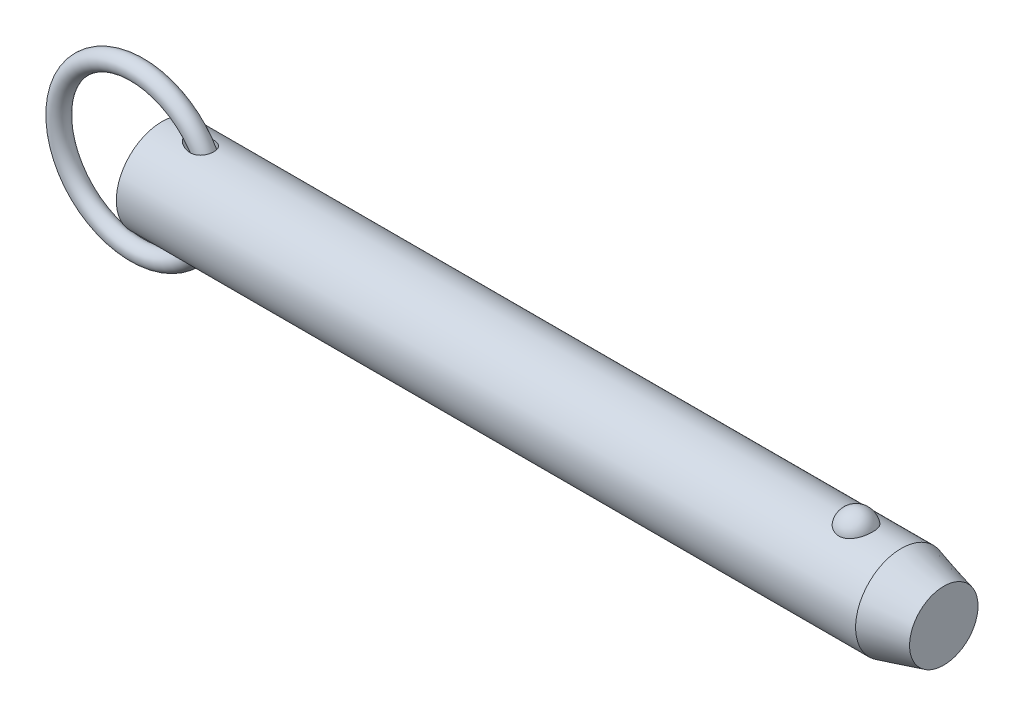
ISO-10303-21;
HEADER;
FILE_DESCRIPTION(('STEP AP214'),'2;1');
FILE_NAME('part.step','',(''),(''),'','','');
FILE_SCHEMA(('AUTOMOTIVE_DESIGN { 1 0 10303 214 1 1 1 1 }'));
ENDSEC;
DATA;
#1=APPLICATION_CONTEXT('core data for automotive mechanical design processes');
#2=APPLICATION_PROTOCOL_DEFINITION('international standard','automotive_design',2000,#1);
#3=PRODUCT_CONTEXT('',#1,'mechanical');
#4=PRODUCT('Part','Part','',(#3));
#5=PRODUCT_RELATED_PRODUCT_CATEGORY('part','',(#4));
#6=PRODUCT_DEFINITION_FORMATION('','',#4);
#7=PRODUCT_DEFINITION_CONTEXT('part definition',#1,'design');
#8=PRODUCT_DEFINITION('design','',#6,#7);
#9=PRODUCT_DEFINITION_SHAPE('','',#8);
#10=(LENGTH_UNIT() NAMED_UNIT(*) SI_UNIT(.MILLI.,.METRE.));
#11=(NAMED_UNIT(*) PLANE_ANGLE_UNIT() SI_UNIT($,.RADIAN.));
#12=(NAMED_UNIT(*) SI_UNIT($,.STERADIAN.) SOLID_ANGLE_UNIT());
#13=UNCERTAINTY_MEASURE_WITH_UNIT(LENGTH_MEASURE(1.E-05),#10,'distance_accuracy_value','');
#14=(GEOMETRIC_REPRESENTATION_CONTEXT(3) GLOBAL_UNCERTAINTY_ASSIGNED_CONTEXT((#13)) GLOBAL_UNIT_ASSIGNED_CONTEXT((#10,
#11,#12)) REPRESENTATION_CONTEXT('',''));
#15=CARTESIAN_POINT('',(0.,0.,0.));
#16=DIRECTION('',(0.,0.,1.));
#17=DIRECTION('',(1.,0.,0.));
#18=AXIS2_PLACEMENT_3D('',#15,#16,#17);
#19=CARTESIAN_POINT('',(-6.08699288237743,0.,0.));
#20=DIRECTION('',(0.,0.,1.));
#21=DIRECTION('',(1.,0.,0.));
#22=AXIS2_PLACEMENT_3D('',#19,#20,#21);
#23=TOROIDAL_SURFACE('',#22,19.05,2.223);
#24=CARTESIAN_POINT('',(15.1860071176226,0.,0.));
#25=VERTEX_POINT('',#24);
#26=VERTEX_LOOP('',#25);
#27=FACE_BOUND('',#26,.T.);
#28=ADVANCED_FACE('P0_F12',(#27),#23,.T.);
#29=CLOSED_SHELL('',(#28));
#30=MANIFOLD_SOLID_BREP('P0_B1',#29);
#31=CARTESIAN_POINT('',(0.,0.,0.));
#32=DIRECTION('',(1.,0.,0.));
#33=DIRECTION('',(0.,0.,-1.));
#34=AXIS2_PLACEMENT_3D('',#31,#32,#33);
#35=CYLINDRICAL_SURFACE('',#34,11.115);
#36=CARTESIAN_POINT('',(6.41405181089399,11.0227946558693,-1.4287136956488));
#37=CARTESIAN_POINT('',(6.49338916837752,11.0115377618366,-1.51556642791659));
#38=CARTESIAN_POINT('',(6.5776546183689,10.9998263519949,-1.59789397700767));
#39=CARTESIAN_POINT('',(6.75386647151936,10.9760304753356,-1.75391400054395));
#40=CARTESIAN_POINT('',(6.84582247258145,10.9639455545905,-1.82759540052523));
#41=CARTESIAN_POINT('',(7.03627827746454,10.9397989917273,-1.96698954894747));
#42=CARTESIAN_POINT('',(7.1348083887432,10.9277377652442,-2.03266078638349));
#43=CARTESIAN_POINT('',(7.33681032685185,10.9041015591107,-2.1558582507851));
#44=CARTESIAN_POINT('',(7.44028007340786,10.8925263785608,-2.21338786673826));
#45=CARTESIAN_POINT('',(7.64386117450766,10.8710104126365,-2.31666528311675));
#46=CARTESIAN_POINT('',(7.74368989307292,10.8610119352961,-2.36295942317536));
#47=CARTESIAN_POINT('',(7.94637195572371,10.8420168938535,-2.44863486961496));
#48=CARTESIAN_POINT('',(8.0492261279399,10.8330206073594,-2.48801426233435));
#49=CARTESIAN_POINT('',(8.3611557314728,10.807980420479,-2.59542730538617));
#50=CARTESIAN_POINT('',(8.57411849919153,10.7938278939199,-2.65299817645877));
#51=CARTESIAN_POINT('',(9.00825016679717,10.7725818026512,-2.73800108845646));
#52=CARTESIAN_POINT('',(9.22947335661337,10.7655491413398,-2.76517330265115));
#53=CARTESIAN_POINT('',(9.6736814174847,10.7605872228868,-2.78445308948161));
#54=CARTESIAN_POINT('',(9.89666486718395,10.7626512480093,-2.77658653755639));
#55=CARTESIAN_POINT('',(10.2950172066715,10.7754452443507,-2.72644436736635));
#56=CARTESIAN_POINT('',(10.4712789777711,10.7844280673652,-2.69109376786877));
#57=CARTESIAN_POINT('',(10.7292776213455,10.8024982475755,-2.61722365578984));
#58=CARTESIAN_POINT('',(10.8142337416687,10.8092901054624,-2.58911576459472));
#59=CARTESIAN_POINT('',(10.9813218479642,10.8242580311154,-2.52581287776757));
#60=CARTESIAN_POINT('',(11.0634550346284,10.8324335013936,-2.49062094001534));
#61=CARTESIAN_POINT('',(11.2247418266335,10.8500287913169,-2.41281958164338));
#62=CARTESIAN_POINT('',(11.3038694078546,10.8594572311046,-2.37015806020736));
#63=CARTESIAN_POINT('',(11.4576781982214,10.8792243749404,-2.27770403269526));
#64=CARTESIAN_POINT('',(11.5323615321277,10.8895626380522,-2.22791497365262));
#65=CARTESIAN_POINT('',(11.6765388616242,10.9108113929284,-2.12140590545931));
#66=CARTESIAN_POINT('',(11.7460329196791,10.9217218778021,-2.06468597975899));
#67=CARTESIAN_POINT('',(11.8790597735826,10.9437207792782,-1.94471764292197));
#68=CARTESIAN_POINT('',(11.9425932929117,10.9548091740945,-1.88147002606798));
#69=CARTESIAN_POINT('',(12.109388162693,10.9851999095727,-1.69784918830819));
#70=CARTESIAN_POINT('',(12.205655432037,11.0042655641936,-1.57093023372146));
#71=CARTESIAN_POINT('',(12.374151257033,11.0393391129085,-1.3017676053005));
#72=CARTESIAN_POINT('',(12.4463875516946,11.0553479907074,-1.15952888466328));
#73=CARTESIAN_POINT('',(12.5615818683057,11.0816338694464,-0.871972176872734));
#74=CARTESIAN_POINT('',(12.6058896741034,11.0921698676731,-0.727217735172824));
#75=CARTESIAN_POINT('',(12.6699315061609,11.1075802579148,-0.432089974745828));
#76=CARTESIAN_POINT('',(12.6896681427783,11.1124552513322,-0.281717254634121));
#77=CARTESIAN_POINT('',(12.704022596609,11.1159901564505,0.0188164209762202));
#78=CARTESIAN_POINT('',(12.6988836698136,11.1147102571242,0.168965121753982));
#79=CARTESIAN_POINT('',(12.6641681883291,11.1062126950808,0.466238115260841));
#80=CARTESIAN_POINT('',(12.6345920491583,11.0989951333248,0.61336245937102));
#81=CARTESIAN_POINT('',(12.5517453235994,11.0794095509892,0.900330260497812));
#82=CARTESIAN_POINT('',(12.4984878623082,11.0670443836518,1.0401777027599));
#83=CARTESIAN_POINT('',(12.3696588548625,11.0385082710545,1.308745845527));
#84=CARTESIAN_POINT('',(12.2940887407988,11.0223375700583,1.43746725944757));
#85=CARTESIAN_POINT('',(12.122380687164,10.987872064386,1.68079704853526));
#86=CARTESIAN_POINT('',(12.0261637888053,10.969569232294,1.79534850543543));
#87=CARTESIAN_POINT('',(11.8161707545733,10.932836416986,2.00695695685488));
#88=CARTESIAN_POINT('',(11.7023941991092,10.9144064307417,2.10401353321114));
#89=CARTESIAN_POINT('',(11.4575656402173,10.8788057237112,2.28105326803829));
#90=CARTESIAN_POINT('',(11.3261451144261,10.8616794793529,2.36053412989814));
#91=CARTESIAN_POINT('',(11.0523589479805,10.8308019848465,2.49839044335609));
#92=CARTESIAN_POINT('',(10.9099908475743,10.8170514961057,2.55676113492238));
#93=CARTESIAN_POINT('',(10.6060622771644,10.7929728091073,2.65666105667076));
#94=CARTESIAN_POINT('',(10.4438877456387,10.7830209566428,2.69640163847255));
#95=CARTESIAN_POINT('',(10.1154037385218,10.7687230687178,2.75293129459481));
#96=CARTESIAN_POINT('',(9.94909141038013,10.7643810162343,2.76970406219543));
#97=CARTESIAN_POINT('',(9.54387061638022,10.7604809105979,2.7848723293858));
#98=CARTESIAN_POINT('',(9.30446860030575,10.7637793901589,2.77227753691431));
#99=CARTESIAN_POINT('',(8.94961255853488,10.7757341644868,2.72524141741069));
#100=CARTESIAN_POINT('',(8.83186896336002,10.7808994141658,2.70482239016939));
#101=CARTESIAN_POINT('',(8.59835142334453,10.7932548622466,2.65509992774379));
#102=CARTESIAN_POINT('',(8.48257728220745,10.8004448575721,2.62579738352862));
#103=CARTESIAN_POINT('',(8.25208469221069,10.8166382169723,2.55827624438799));
#104=CARTESIAN_POINT('',(8.1374021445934,10.8256649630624,2.51994155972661));
#105=CARTESIAN_POINT('',(7.91132058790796,10.8451170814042,2.43486475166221));
#106=CARTESIAN_POINT('',(7.79992154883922,10.8555424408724,2.38812270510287));
#107=CARTESIAN_POINT('',(7.58115677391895,10.8774251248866,2.28638483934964));
#108=CARTESIAN_POINT('',(7.47378802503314,10.8888816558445,2.23139534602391));
#109=CARTESIAN_POINT('',(7.26385624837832,10.9124540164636,2.11310265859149));
#110=CARTESIAN_POINT('',(7.16129168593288,10.9245696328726,2.04980214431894));
#111=CARTESIAN_POINT('',(6.91882218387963,10.9543689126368,1.88540538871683));
#112=CARTESIAN_POINT('',(6.78193778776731,10.9721958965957,1.77979827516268));
#113=CARTESIAN_POINT('',(6.52472441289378,11.0070222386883,1.54989693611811));
#114=CARTESIAN_POINT('',(6.40436902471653,11.0240228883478,1.42563320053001));
#115=CARTESIAN_POINT('',(6.21838804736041,11.0509658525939,1.19529359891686));
#116=CARTESIAN_POINT('',(6.14691885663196,11.0615430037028,1.09404520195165));
#117=CARTESIAN_POINT('',(6.0204349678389,11.0805004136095,0.881508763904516));
#118=CARTESIAN_POINT('',(5.96539400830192,11.0888841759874,0.770237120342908));
#119=CARTESIAN_POINT('',(5.88475453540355,11.1012553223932,0.560577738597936));
#120=CARTESIAN_POINT('',(5.85559643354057,11.1057686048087,0.463603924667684));
#121=CARTESIAN_POINT('',(5.81381299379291,11.1122523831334,0.266083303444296));
#122=CARTESIAN_POINT('',(5.80117118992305,11.1142254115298,0.165540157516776));
#123=CARTESIAN_POINT('',(5.79363815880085,11.1153999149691,-0.0364747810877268));
#124=CARTESIAN_POINT('',(5.79878799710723,11.1145949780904,-0.137948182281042));
#125=CARTESIAN_POINT('',(5.82639592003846,11.1102987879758,-0.338493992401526));
#126=CARTESIAN_POINT('',(5.8488723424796,11.1068046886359,-0.437563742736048));
#127=CARTESIAN_POINT('',(5.91510741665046,11.0965857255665,-0.649968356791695));
#128=CARTESIAN_POINT('',(5.96220905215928,11.0893566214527,-0.7622229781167));
#129=CARTESIAN_POINT('',(6.0737844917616,11.072471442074,-0.977396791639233));
#130=CARTESIAN_POINT('',(6.13826787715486,11.0628140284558,-1.08031079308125));
#131=CARTESIAN_POINT('',(6.24101077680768,11.0477136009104,-1.2219580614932));
#132=CARTESIAN_POINT('',(6.27403486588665,11.042895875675,-1.26469183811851));
#133=CARTESIAN_POINT('',(6.34238022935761,11.0330152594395,-1.34817011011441));
#134=CARTESIAN_POINT('',(6.37769867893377,11.0279526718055,-1.38891694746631));
#135=CARTESIAN_POINT('',(6.41405181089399,11.0227946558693,-1.4287136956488));
#136=B_SPLINE_CURVE_WITH_KNOTS('',3,(#36,#37,#38,#39,#40,#41,#42,#43,#44,#45,#46,#47,#48,#49,
#50,#51,#52,#53,#54,#55,#56,#57,#58,#59,#60,#61,#62,#63,#64,#65,#66,#67,#68,#69,#70,#71,#72,#73,
#74,#75,#76,#77,#78,#79,#80,#81,#82,#83,#84,#85,#86,#87,#88,#89,#90,#91,#92,#93,#94,#95,#96,#97,
#98,#99,#100,#101,#102,#103,#104,#105,#106,#107,#108,#109,#110,#111,#112,#113,#114,#115,#116,
#117,#118,#119,#120,#121,#122,#123,#124,#125,#126,#127,#128,#129,#130,#131,#132,#133,#134,#135),
.UNSPECIFIED.,.T.,.F.,(4,2,2,2,2,2,2,2,2,2,2,2,2,2,2,2,2,2,2,2,2,2,2,2,2,2,2,2,2,2,2,2,2,2,2,2,
2,2,2,2,2,2,2,2,2,2,2,2,2,4),(0.,0.354433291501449,0.709315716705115,1.0659654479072,
1.42246628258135,1.75367157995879,2.08496839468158,2.74582009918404,3.41227815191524,
4.07824412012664,4.61583787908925,4.88478112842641,5.1536085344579,5.42439170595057,
5.69504436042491,5.96569375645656,6.23631025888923,6.71490729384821,7.19335005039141,
7.64641437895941,8.09943057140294,8.54802575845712,8.99661331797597,9.44495256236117,
9.89326303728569,10.3433195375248,10.7933867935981,11.2550086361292,11.7167345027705,
12.2165866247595,12.7167934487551,13.4318876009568,13.7904664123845,14.1490092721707,
14.5124394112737,14.8758662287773,15.239015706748,15.6020483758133,16.1219860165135,
16.6410830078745,17.0130520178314,17.3844231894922,17.6872330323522,17.9897407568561,
18.2929471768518,18.5964749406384,18.9603532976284,19.3244326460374,19.4870338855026,
19.649438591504),.UNSPECIFIED.);
#137=CARTESIAN_POINT('',(6.41405181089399,11.0227946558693,-1.4287136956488));
#138=VERTEX_POINT('',#137);
#139=EDGE_CURVE('P1_E40',#138,#138,#136,.T.);
#140=ORIENTED_EDGE('',*,*,#139,.T.);
#141=EDGE_LOOP('',(#140));
#142=FACE_BOUND('',#141,.T.);
#143=CARTESIAN_POINT('',(180.129563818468,0.,0.));
#144=DIRECTION('',(1.,0.,0.));
#145=DIRECTION('',(0.,0.,-1.));
#146=AXIS2_PLACEMENT_3D('',#143,#144,#145);
#147=CIRCLE('',#146,11.115);
#148=CARTESIAN_POINT('',(180.129563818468,0.,-11.115));
#149=VERTEX_POINT('',#148);
#150=EDGE_CURVE('P1_E25',#149,#149,#147,.T.);
#151=ORIENTED_EDGE('',*,*,#150,.F.);
#152=EDGE_LOOP('',(#151));
#153=FACE_BOUND('',#152,.T.);
#154=CARTESIAN_POINT('',(0.,0.,0.));
#155=DIRECTION('',(1.,0.,0.));
#156=DIRECTION('',(0.,0.,-1.));
#157=AXIS2_PLACEMENT_3D('',#154,#155,#156);
#158=CIRCLE('',#157,11.115);
#159=CARTESIAN_POINT('',(0.,0.,-11.115));
#160=VERTEX_POINT('',#159);
#161=EDGE_CURVE('P1_E9',#160,#160,#158,.T.);
#162=ORIENTED_EDGE('',*,*,#161,.T.);
#163=EDGE_LOOP('',(#162));
#164=FACE_BOUND('',#163,.T.);
#165=CARTESIAN_POINT('',(169.131068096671,10.3028087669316,4.17077409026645));
#166=CARTESIAN_POINT('',(168.914775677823,10.3028003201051,4.17078240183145));
#167=CARTESIAN_POINT('',(168.698548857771,10.3098895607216,4.15340593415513));
#168=CARTESIAN_POINT('',(168.272540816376,10.3373834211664,4.08449540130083));
#169=CARTESIAN_POINT('',(168.062757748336,10.3577841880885,4.0329712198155));
#170=CARTESIAN_POINT('',(167.655782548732,10.4095237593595,3.89746513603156));
#171=CARTESIAN_POINT('',(167.458572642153,10.4408466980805,3.81353029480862));
#172=CARTESIAN_POINT('',(167.081338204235,10.5110236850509,3.61560339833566));
#173=CARTESIAN_POINT('',(166.901317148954,10.5498792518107,3.50160528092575));
#174=CARTESIAN_POINT('',(166.557684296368,10.6322884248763,3.24292464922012));
#175=CARTESIAN_POINT('',(166.394686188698,10.6759443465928,3.0974604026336));
#176=CARTESIAN_POINT('',(166.094591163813,10.7625291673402,2.78171925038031));
#177=CARTESIAN_POINT('',(165.957499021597,10.8054579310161,2.61143778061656));
#178=CARTESIAN_POINT('',(165.706408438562,10.8881935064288,2.24226695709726));
#179=CARTESIAN_POINT('',(165.593710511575,10.9277761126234,2.04244123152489));
#180=CARTESIAN_POINT('',(165.401777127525,10.997484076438,1.62578254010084));
#181=CARTESIAN_POINT('',(165.322544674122,11.0276085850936,1.40894804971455));
#182=CARTESIAN_POINT('',(165.198303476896,11.0756732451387,0.961250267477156));
#183=CARTESIAN_POINT('',(165.153760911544,11.0934470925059,0.730239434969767));
#184=CARTESIAN_POINT('',(165.101569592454,11.1143331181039,0.26343964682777));
#185=CARTESIAN_POINT('',(165.093920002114,11.1174456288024,0.0276507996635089));
#186=CARTESIAN_POINT('',(165.11561056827,11.1087161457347,-0.440729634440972));
#187=CARTESIAN_POINT('',(165.144762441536,11.0969502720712,-0.6733313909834));
#188=CARTESIAN_POINT('',(165.239143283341,11.0597872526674,-1.12996621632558));
#189=CARTESIAN_POINT('',(165.304372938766,11.0343898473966,-1.35399912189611));
#190=CARTESIAN_POINT('',(165.46969844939,10.972515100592,-1.78750286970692));
#191=CARTESIAN_POINT('',(165.56983863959,10.9360236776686,-1.99695478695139));
#192=CARTESIAN_POINT('',(165.802940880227,10.8557595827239,-2.3952066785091));
#193=CARTESIAN_POINT('',(165.935905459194,10.8119863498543,-2.5840050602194));
#194=CARTESIAN_POINT('',(166.232407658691,10.7216733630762,-2.93635726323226));
#195=CARTESIAN_POINT('',(166.396056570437,10.675123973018,-3.09981510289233));
#196=CARTESIAN_POINT('',(166.749860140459,10.5846571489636,-3.39592247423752));
#197=CARTESIAN_POINT('',(166.940012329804,10.5407394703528,-3.52857487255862));
#198=CARTESIAN_POINT('',(167.33750141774,10.4616690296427,-3.75646057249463));
#199=CARTESIAN_POINT('',(167.54436705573,10.4263443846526,-3.85245432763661));
#200=CARTESIAN_POINT('',(167.97295417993,10.3675574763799,-4.00798747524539));
#201=CARTESIAN_POINT('',(168.194670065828,10.344090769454,-4.0675405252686));
#202=CARTESIAN_POINT('',(168.634669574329,10.3128282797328,-4.14614314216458));
#203=CARTESIAN_POINT('',(168.852565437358,10.3043040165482,-4.1670783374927));
#204=CARTESIAN_POINT('',(169.28894951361,10.3016771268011,-4.17357158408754));
#205=CARTESIAN_POINT('',(169.507437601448,10.3075716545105,-4.15913661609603));
#206=CARTESIAN_POINT('',(169.931744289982,10.3326686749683,-4.09636961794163));
#207=CARTESIAN_POINT('',(170.137745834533,10.3514555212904,-4.0490957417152));
#208=CARTESIAN_POINT('',(170.538576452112,10.399818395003,-3.92320197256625));
#209=CARTESIAN_POINT('',(170.7334046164,10.4293952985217,-3.84457953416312));
#210=CARTESIAN_POINT('',(171.111191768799,10.4969600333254,-3.65612410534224));
#211=CARTESIAN_POINT('',(171.293797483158,10.5351178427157,-3.54564545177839));
#212=CARTESIAN_POINT('',(171.638204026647,10.6154999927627,-3.29718036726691));
#213=CARTESIAN_POINT('',(171.800000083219,10.657725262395,-3.15918764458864));
#214=CARTESIAN_POINT('',(172.106959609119,10.744212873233,-2.85163580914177));
#215=CARTESIAN_POINT('',(172.250891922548,10.7884718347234,-2.68084605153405));
#216=CARTESIAN_POINT('',(172.509237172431,10.872374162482,-2.31721864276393));
#217=CARTESIAN_POINT('',(172.623644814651,10.9120167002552,-2.12437704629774));
#218=CARTESIAN_POINT('',(172.823873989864,10.9838919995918,-1.71516999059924));
#219=CARTESIAN_POINT('',(172.90866178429,11.0158465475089,-1.49824866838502));
#220=CARTESIAN_POINT('',(173.04268382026,11.0673523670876,-1.05228572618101));
#221=CARTESIAN_POINT('',(173.091917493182,11.086903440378,-0.823243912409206));
#222=CARTESIAN_POINT('',(173.153891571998,11.1116323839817,-0.359087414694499));
#223=CARTESIAN_POINT('',(173.166566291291,11.1167843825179,-0.123962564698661));
#224=CARTESIAN_POINT('',(173.154973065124,11.1121144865,0.345220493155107));
#225=CARTESIAN_POINT('',(173.130705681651,11.1022928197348,0.579278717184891));
#226=CARTESIAN_POINT('',(173.045907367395,11.0687504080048,1.03866534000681));
#227=CARTESIAN_POINT('',(172.985529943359,11.0450885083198,1.26402641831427));
#228=CARTESIAN_POINT('',(172.829853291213,10.9863185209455,1.70076772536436));
#229=CARTESIAN_POINT('',(172.734551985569,10.9512097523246,1.91214712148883));
#230=CARTESIAN_POINT('',(172.510397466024,10.8729733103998,2.316083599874));
#231=CARTESIAN_POINT('',(172.381380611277,10.8298068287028,2.50854240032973));
#232=CARTESIAN_POINT('',(172.092732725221,10.7401896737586,2.86808766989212));
#233=CARTESIAN_POINT('',(171.933102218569,10.6937390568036,3.03517457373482));
#234=CARTESIAN_POINT('',(171.587534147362,10.6029321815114,3.33857581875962));
#235=CARTESIAN_POINT('',(171.401708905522,10.5585680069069,3.47501541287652));
#236=CARTESIAN_POINT('',(171.007875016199,10.4769321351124,3.71390897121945));
#237=CARTESIAN_POINT('',(170.799863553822,10.439661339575,3.81635861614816));
#238=CARTESIAN_POINT('',(170.354066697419,10.3749407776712,3.98910631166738));
#239=CARTESIAN_POINT('',(170.115234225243,10.3482457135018,4.05700929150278));
#240=CARTESIAN_POINT('',(169.627925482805,10.312188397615,4.14782844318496));
#241=CARTESIAN_POINT('',(169.379453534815,10.3028184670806,4.17076454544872));
#242=CARTESIAN_POINT('',(169.131068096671,10.3028087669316,4.17077409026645));
#243=B_SPLINE_CURVE_WITH_KNOTS('',3,(#165,#166,#167,#168,#169,#170,#171,#172,#173,#174,#175,
#176,#177,#178,#179,#180,#181,#182,#183,#184,#185,#186,#187,#188,#189,#190,#191,#192,#193,#194,
#195,#196,#197,#198,#199,#200,#201,#202,#203,#204,#205,#206,#207,#208,#209,#210,#211,#212,#213,
#214,#215,#216,#217,#218,#219,#220,#221,#222,#223,#224,#225,#226,#227,#228,#229,#230,#231,#232,
#233,#234,#235,#236,#237,#238,#239,#240,#241,#242),.UNSPECIFIED.,.T.,.F.,(4,2,2,2,2,2,2,2,2,2,2,
2,2,2,2,2,2,2,2,2,2,2,2,2,2,2,2,2,2,2,2,2,2,2,2,2,2,2,4),(0.,0.64796614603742,1.29574482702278,
1.9425864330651,2.58955857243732,3.25496465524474,3.92049326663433,4.61566368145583,
5.31089647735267,6.01531821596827,6.71972398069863,7.42054043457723,8.12137023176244,
8.82309331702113,9.5248704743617,10.2292439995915,10.9335519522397,11.6223330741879,
12.3108558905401,12.9647664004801,13.6185478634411,14.252184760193,14.8858731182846,
15.5334360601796,16.1811472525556,16.8611459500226,17.5412664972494,18.2431855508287,
18.9451158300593,19.6483065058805,20.3514864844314,21.0516982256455,21.7519516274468,
22.4556690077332,23.1593743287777,23.860149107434,24.5610129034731,25.3054529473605,
26.049562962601),.UNSPECIFIED.);
#244=CARTESIAN_POINT('',(169.131068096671,10.3028087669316,4.17077409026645));
#245=VERTEX_POINT('',#244);
#246=EDGE_CURVE('P1_E34',#245,#245,#243,.T.);
#247=ORIENTED_EDGE('',*,*,#246,.T.);
#248=EDGE_LOOP('',(#247));
#249=FACE_BOUND('',#248,.T.);
#250=CARTESIAN_POINT('',(6.41405181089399,-11.0227946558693,-1.4287136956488));
#251=CARTESIAN_POINT('',(6.3312406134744,-11.0345445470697,-1.33806125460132));
#252=CARTESIAN_POINT('',(6.25372866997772,-11.0458090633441,-1.24240732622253));
#253=CARTESIAN_POINT('',(6.11277905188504,-11.0666115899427,-1.04095704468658));
#254=CARTESIAN_POINT('',(6.04933920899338,-11.0761498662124,-0.935162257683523));
#255=CARTESIAN_POINT('',(5.94029181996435,-11.0927063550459,-0.712476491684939));
#256=CARTESIAN_POINT('',(5.89492964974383,-11.0996897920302,-0.595457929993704));
#257=CARTESIAN_POINT('',(5.84498161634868,-11.1074141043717,-0.414997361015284));
#258=CARTESIAN_POINT('',(5.83135004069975,-11.1095300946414,-0.354047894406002));
#259=CARTESIAN_POINT('',(5.81051649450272,-11.1127688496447,-0.231041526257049));
#260=CARTESIAN_POINT('',(5.80331311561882,-11.1138918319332,-0.1689848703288));
#261=CARTESIAN_POINT('',(5.7929652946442,-11.1155042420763,-0.000484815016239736));
#262=CARTESIAN_POINT('',(5.79625267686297,-11.1149904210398,0.106437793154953));
#263=CARTESIAN_POINT('',(5.82213676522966,-11.1109609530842,0.317809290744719));
#264=CARTESIAN_POINT('',(5.84474662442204,-11.1074432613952,0.422256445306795));
#265=CARTESIAN_POINT('',(5.911131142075,-11.097197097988,0.63936180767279));
#266=CARTESIAN_POINT('',(5.95733120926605,-11.090102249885,0.751250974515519));
#267=CARTESIAN_POINT('',(6.06709542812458,-11.0734770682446,0.965912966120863));
#268=CARTESIAN_POINT('',(6.13068735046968,-11.06394284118,1.06867085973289));
#269=CARTESIAN_POINT('',(6.30294237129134,-11.0385920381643,1.30890635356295));
#270=CARTESIAN_POINT('',(6.41896200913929,-11.0218881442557,1.44097376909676));
#271=CARTESIAN_POINT('',(6.66989654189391,-10.9871512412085,1.68553954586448));
#272=CARTESIAN_POINT('',(6.80485520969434,-10.9691152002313,1.79799117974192));
#273=CARTESIAN_POINT('',(7.04881236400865,-10.9382283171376,1.97587596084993));
#274=CARTESIAN_POINT('',(7.15465712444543,-10.9253240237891,2.04570822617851));
#275=CARTESIAN_POINT('',(7.37202504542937,-10.9000987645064,2.17611840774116));
#276=CARTESIAN_POINT('',(7.48355057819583,-10.8877780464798,2.23669241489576));
#277=CARTESIAN_POINT('',(7.71132418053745,-10.8641580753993,2.34873831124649));
#278=CARTESIAN_POINT('',(7.82757727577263,-10.8528599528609,2.40020018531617));
#279=CARTESIAN_POINT('',(8.06386825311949,-10.8317234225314,2.49385169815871));
#280=CARTESIAN_POINT('',(8.18390558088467,-10.8218848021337,2.53604268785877));
#281=CARTESIAN_POINT('',(8.42918336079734,-10.8039208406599,2.61152283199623));
#282=CARTESIAN_POINT('',(8.55447802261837,-10.7958283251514,2.64464414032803));
#283=CARTESIAN_POINT('',(8.8075212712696,-10.781995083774,2.70048793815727));
#284=CARTESIAN_POINT('',(8.93527019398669,-10.7762546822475,2.72320899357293));
#285=CARTESIAN_POINT('',(9.19210176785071,-10.7675291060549,2.75750994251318));
#286=CARTESIAN_POINT('',(9.32118105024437,-10.7645381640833,2.76911315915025));
#287=CARTESIAN_POINT('',(9.57984338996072,-10.761622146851,2.78042035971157));
#288=CARTESIAN_POINT('',(9.70942621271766,-10.7616957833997,2.78012934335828));
#289=CARTESIAN_POINT('',(10.0243125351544,-10.7659059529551,2.76381534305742));
#290=CARTESIAN_POINT('',(10.209307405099,-10.7717977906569,2.74099674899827));
#291=CARTESIAN_POINT('',(10.5731188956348,-10.7905408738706,2.66626238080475));
#292=CARTESIAN_POINT('',(10.7519389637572,-10.8033881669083,2.61436313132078));
#293=CARTESIAN_POINT('',(11.0114289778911,-10.8271584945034,2.51336808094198));
#294=CARTESIAN_POINT('',(11.096831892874,-10.835881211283,2.47562331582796));
#295=CARTESIAN_POINT('',(11.2636000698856,-10.8545688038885,2.39236170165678));
#296=CARTESIAN_POINT('',(11.3449673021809,-10.8645330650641,2.3468486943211));
#297=CARTESIAN_POINT('',(11.5027832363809,-10.8853818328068,2.24815967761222));
#298=CARTESIAN_POINT('',(11.5792327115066,-10.8962661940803,2.19498487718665));
#299=CARTESIAN_POINT('',(11.7263315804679,-10.9185541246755,2.08128855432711));
#300=CARTESIAN_POINT('',(11.7969818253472,-10.9299576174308,2.02076811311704));
#301=CARTESIAN_POINT('',(11.9817953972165,-10.9613645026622,1.84513663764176));
#302=CARTESIAN_POINT('',(12.0893012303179,-10.9814643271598,1.72286660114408));
#303=CARTESIAN_POINT('',(12.2803576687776,-11.0193991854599,1.46066991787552));
#304=CARTESIAN_POINT('',(12.3639173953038,-11.0372350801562,1.3207500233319));
#305=CARTESIAN_POINT('',(12.4996220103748,-11.0672969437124,1.03778067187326));
#306=CARTESIAN_POINT('',(12.5535315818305,-11.0798242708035,0.895607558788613));
#307=CARTESIAN_POINT('',(12.636874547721,-11.0995427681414,0.603918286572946));
#308=CARTESIAN_POINT('',(12.6663115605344,-11.1067347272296,0.454403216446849));
#309=CARTESIAN_POINT('',(12.6997387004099,-11.1149224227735,0.154577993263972));
#310=CARTESIAN_POINT('',(12.7040886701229,-11.1160057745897,0.00431019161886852));
#311=CARTESIAN_POINT('',(12.6882048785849,-11.1120956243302,-0.294841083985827));
#312=CARTESIAN_POINT('',(12.6679715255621,-11.1071022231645,-0.443724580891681));
#313=CARTESIAN_POINT('',(12.6034470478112,-11.0915888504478,-0.735688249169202));
#314=CARTESIAN_POINT('',(12.5591858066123,-11.0810757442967,-0.878775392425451));
#315=CARTESIAN_POINT('',(12.4477416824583,-11.0556687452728,-1.15529525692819));
#316=CARTESIAN_POINT('',(12.3805601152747,-11.0407751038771,-1.2887285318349));
#317=CARTESIAN_POINT('',(12.2248919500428,-11.0081839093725,-1.54257976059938));
#318=CARTESIAN_POINT('',(12.1363549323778,-10.9904797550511,-1.66296592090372));
#319=CARTESIAN_POINT('',(11.9406137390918,-10.9541951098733,-1.88726577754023));
#320=CARTESIAN_POINT('',(11.833409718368,-10.9356146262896,-1.99117961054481));
#321=CARTESIAN_POINT('',(11.601318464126,-10.8991360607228,-2.18213646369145));
#322=CARTESIAN_POINT('',(11.4761325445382,-10.8812577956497,-2.26881927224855));
#323=CARTESIAN_POINT('',(11.2134852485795,-10.8482871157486,-2.42157282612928));
#324=CARTESIAN_POINT('',(11.0760218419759,-10.8331951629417,-2.48764015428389));
#325=CARTESIAN_POINT('',(10.7828968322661,-10.8061050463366,-2.60290068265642));
#326=CARTESIAN_POINT('',(10.6266338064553,-10.7943907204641,-2.65062248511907));
#327=CARTESIAN_POINT('',(10.3086617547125,-10.7762429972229,-2.72345054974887));
#328=CARTESIAN_POINT('',(10.146948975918,-10.7698133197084,-2.74854088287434));
#329=CARTESIAN_POINT('',(9.75541304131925,-10.7608036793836,-2.78368719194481));
#330=CARTESIAN_POINT('',(9.52459435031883,-10.7608467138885,-2.78350276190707));
#331=CARTESIAN_POINT('',(9.0660496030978,-10.7702674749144,-2.74677945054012));
#332=CARTESIAN_POINT('',(8.83832966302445,-10.7796615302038,-2.71017697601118));
#333=CARTESIAN_POINT('',(8.38783466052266,-10.8058248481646,-2.60392490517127));
#334=CARTESIAN_POINT('',(8.16517101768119,-10.8226939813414,-2.53382676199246));
#335=CARTESIAN_POINT('',(7.84087311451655,-10.8516548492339,-2.40555545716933));
#336=CARTESIAN_POINT('',(7.73435551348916,-10.8619221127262,-2.35892455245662));
#337=CARTESIAN_POINT('',(7.52510420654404,-10.883357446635,-2.25797017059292));
#338=CARTESIAN_POINT('',(7.42236986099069,-10.8945253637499,-2.20364800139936));
#339=CARTESIAN_POINT('',(7.23808758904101,-10.915528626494,-2.09688018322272));
#340=CARTESIAN_POINT('',(7.15584631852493,-10.9252787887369,-2.04561072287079));
#341=CARTESIAN_POINT('',(6.99510576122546,-10.944960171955,-1.93754729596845));
#342=CARTESIAN_POINT('',(6.91660574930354,-10.9548913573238,-1.88075440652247));
#343=CARTESIAN_POINT('',(6.76418133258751,-10.974690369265,-1.7615450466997));
#344=CARTESIAN_POINT('',(6.69024940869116,-10.984558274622,-1.69913825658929));
#345=CARTESIAN_POINT('',(6.54780119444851,-11.0039826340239,-1.56842485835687));
#346=CARTESIAN_POINT('',(6.47928247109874,-11.0135392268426,-1.50012092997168));
#347=CARTESIAN_POINT('',(6.41405181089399,-11.0227946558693,-1.4287136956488));
#348=B_SPLINE_CURVE_WITH_KNOTS('',3,(#250,#251,#252,#253,#254,#255,#256,#257,#258,#259,#260,
#261,#262,#263,#264,#265,#266,#267,#268,#269,#270,#271,#272,#273,#274,#275,#276,#277,#278,#279,
#280,#281,#282,#283,#284,#285,#286,#287,#288,#289,#290,#291,#292,#293,#294,#295,#296,#297,#298,
#299,#300,#301,#302,#303,#304,#305,#306,#307,#308,#309,#310,#311,#312,#313,#314,#315,#316,#317,
#318,#319,#320,#321,#322,#323,#324,#325,#326,#327,#328,#329,#330,#331,#332,#333,#334,#335,#336,
#337,#338,#339,#340,#341,#342,#343,#344,#345,#346,#347),.UNSPECIFIED.,.T.,.F.,(4,2,2,2,2,2,2,2,
2,2,2,2,2,2,2,2,2,2,2,2,2,2,2,2,2,2,2,2,2,2,2,2,2,2,2,2,2,2,2,2,2,2,2,2,2,2,2,2,4),(0.,
0.36983565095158,0.739614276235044,1.1142538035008,1.30141910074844,1.48854338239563,
1.8074587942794,2.12659146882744,2.4883888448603,2.85076733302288,3.3776216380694,
3.90571433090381,4.287639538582,4.66972556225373,5.05222896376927,5.43467659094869,
5.82378546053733,6.21294796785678,6.6012922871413,6.98947336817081,7.54669558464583,
8.10360148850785,8.38458539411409,8.66543074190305,8.94623182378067,9.22699162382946,
9.7162888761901,10.2053995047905,10.6608871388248,11.1163074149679,11.5651786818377,
12.0140424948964,12.4623493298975,12.9106304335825,13.3599804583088,13.8093267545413,
14.2672570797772,14.7252632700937,15.214740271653,15.7045615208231,16.3932594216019,
17.083162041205,17.7825738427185,18.1325177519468,18.4824022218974,18.7744056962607,
19.0663523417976,19.3578048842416,19.6491256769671),.UNSPECIFIED.);
#349=CARTESIAN_POINT('',(6.41405181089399,-11.0227946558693,-1.4287136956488));
#350=VERTEX_POINT('',#349);
#351=EDGE_CURVE('P1_E17',#350,#350,#348,.T.);
#352=ORIENTED_EDGE('',*,*,#351,.T.);
#353=EDGE_LOOP('',(#352));
#354=FACE_BOUND('',#353,.T.);
#355=ADVANCED_FACE('P1_F13',(#142,#153,#164,#249,#354),#35,.T.);
#356=CARTESIAN_POINT('',(0.,0.,0.));
#357=DIRECTION('',(-1.,0.,0.));
#358=DIRECTION('',(0.,0.,1.));
#359=AXIS2_PLACEMENT_3D('',#356,#357,#358);
#360=PLANE('',#359);
#361=ORIENTED_EDGE('',*,*,#161,.F.);
#362=EDGE_LOOP('',(#361));
#363=FACE_BOUND('',#362,.T.);
#364=ADVANCED_FACE('P1_F15',(#363),#360,.T.);
#365=CARTESIAN_POINT('',(190.5,0.,0.));
#366=DIRECTION('',(-1.,0.,0.));
#367=DIRECTION('',(0.,0.,1.));
#368=AXIS2_PLACEMENT_3D('',#365,#366,#367);
#369=CONICAL_SURFACE('',#368,8.33625000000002,0.261799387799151);
#370=ORIENTED_EDGE('',*,*,#150,.T.);
#371=EDGE_LOOP('',(#370));
#372=FACE_BOUND('',#371,.T.);
#373=CARTESIAN_POINT('',(190.5,0.,0.));
#374=DIRECTION('',(1.,0.,0.));
#375=DIRECTION('',(0.,0.,-1.));
#376=AXIS2_PLACEMENT_3D('',#373,#374,#375);
#377=CIRCLE('',#376,8.33625000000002);
#378=CARTESIAN_POINT('',(190.5,0.,-8.33625000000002));
#379=VERTEX_POINT('',#378);
#380=EDGE_CURVE('P1_E30',#379,#379,#377,.T.);
#381=ORIENTED_EDGE('',*,*,#380,.F.);
#382=EDGE_LOOP('',(#381));
#383=FACE_BOUND('',#382,.T.);
#384=ADVANCED_FACE('P1_F55',(#372,#383),#369,.T.);
#385=CARTESIAN_POINT('',(190.5,8.33625000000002,0.));
#386=DIRECTION('',(1.,0.,0.));
#387=DIRECTION('',(0.,0.,-1.));
#388=AXIS2_PLACEMENT_3D('',#385,#386,#387);
#389=PLANE('',#388);
#390=ORIENTED_EDGE('',*,*,#380,.T.);
#391=EDGE_LOOP('',(#390));
#392=FACE_BOUND('',#391,.T.);
#393=ADVANCED_FACE('P1_F51',(#392),#389,.T.);
#394=CARTESIAN_POINT('',(169.131068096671,10.0035,0.));
#395=DIRECTION('',(-1.,0.,0.));
#396=DIRECTION('',(0.,1.,0.));
#397=AXIS2_PLACEMENT_3D('',#394,#395,#396);
#398=SPHERICAL_SURFACE('',#397,4.18150000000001);
#399=ORIENTED_EDGE('',*,*,#246,.F.);
#400=EDGE_LOOP('',(#399));
#401=FACE_BOUND('',#400,.T.);
#402=ADVANCED_FACE('P1_F46',(#401),#398,.T.);
#403=CARTESIAN_POINT('',(-6.08699288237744,0.,0.));
#404=DIRECTION('',(0.,0.,1.));
#405=DIRECTION('',(1.,0.,0.));
#406=AXIS2_PLACEMENT_3D('',#403,#404,#405);
#407=TOROIDAL_SURFACE('',#406,19.05,2.77875);
#408=ORIENTED_EDGE('',*,*,#351,.F.);
#409=EDGE_LOOP('',(#408));
#410=FACE_BOUND('',#409,.T.);
#411=ORIENTED_EDGE('',*,*,#139,.F.);
#412=EDGE_LOOP('',(#411));
#413=FACE_BOUND('',#412,.T.);
#414=ADVANCED_FACE('P1_F50',(#410,#413),#407,.F.);
#415=CLOSED_SHELL('',(#355,#364,#384,#393,#402,#414));
#416=MANIFOLD_SOLID_BREP('P1_B1',#415);
#417=ADVANCED_BREP_SHAPE_REPRESENTATION('',(#18,#30,#416),#14);
#418=SHAPE_DEFINITION_REPRESENTATION(#9,#417);
ENDSEC;
END-ISO-10303-21;
